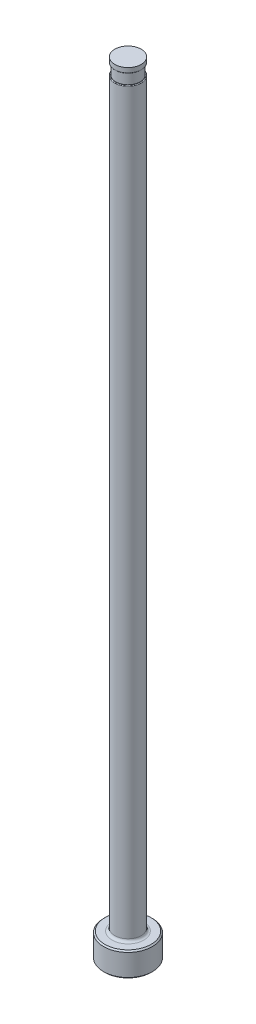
ISO-10303-21;
HEADER;
FILE_DESCRIPTION(('STEP AP214'),'2;1');
FILE_NAME('part.step','',(''),(''),'','','');
FILE_SCHEMA(('AUTOMOTIVE_DESIGN { 1 0 10303 214 1 1 1 1 }'));
ENDSEC;
DATA;
#1=APPLICATION_CONTEXT('core data for automotive mechanical design processes');
#2=APPLICATION_PROTOCOL_DEFINITION('international standard','automotive_design',2000,#1);
#3=PRODUCT_CONTEXT('',#1,'mechanical');
#4=PRODUCT('Part','Part','',(#3));
#5=PRODUCT_RELATED_PRODUCT_CATEGORY('part','',(#4));
#6=PRODUCT_DEFINITION_FORMATION('','',#4);
#7=PRODUCT_DEFINITION_CONTEXT('part definition',#1,'design');
#8=PRODUCT_DEFINITION('design','',#6,#7);
#9=PRODUCT_DEFINITION_SHAPE('','',#8);
#10=(LENGTH_UNIT() NAMED_UNIT(*) SI_UNIT(.MILLI.,.METRE.));
#11=(NAMED_UNIT(*) PLANE_ANGLE_UNIT() SI_UNIT($,.RADIAN.));
#12=(NAMED_UNIT(*) SI_UNIT($,.STERADIAN.) SOLID_ANGLE_UNIT());
#13=UNCERTAINTY_MEASURE_WITH_UNIT(LENGTH_MEASURE(1.E-05),#10,'distance_accuracy_value','');
#14=(GEOMETRIC_REPRESENTATION_CONTEXT(3) GLOBAL_UNCERTAINTY_ASSIGNED_CONTEXT((#13)) GLOBAL_UNIT_ASSIGNED_CONTEXT((#10,
#11,#12)) REPRESENTATION_CONTEXT('',''));
#15=CARTESIAN_POINT('',(0.,0.,0.));
#16=DIRECTION('',(0.,0.,1.));
#17=DIRECTION('',(1.,0.,0.));
#18=AXIS2_PLACEMENT_3D('',#15,#16,#17);
#19=CARTESIAN_POINT('',(-2.57936999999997,151.384,0.));
#20=DIRECTION('',(0.,1.,0.));
#21=DIRECTION('',(0.,0.,1.));
#22=AXIS2_PLACEMENT_3D('',#19,#20,#21);
#23=PLANE('',#22);
#24=CARTESIAN_POINT('',(0.,151.384,0.));
#25=DIRECTION('',(0.,1.,0.));
#26=DIRECTION('',(0.,0.,1.));
#27=AXIS2_PLACEMENT_3D('',#24,#25,#26);
#28=CIRCLE('',#27,2.44728999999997);
#29=CARTESIAN_POINT('',(0.,151.384,2.44728999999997));
#30=VERTEX_POINT('',#29);
#31=EDGE_CURVE('E11',#30,#30,#28,.F.);
#32=ORIENTED_EDGE('',*,*,#31,.T.);
#33=EDGE_LOOP('',(#32));
#34=FACE_BOUND('',#33,.T.);
#35=CARTESIAN_POINT('',(0.,151.384,0.));
#36=DIRECTION('',(0.,1.,0.));
#37=DIRECTION('',(0.,0.,1.));
#38=AXIS2_PLACEMENT_3D('',#35,#36,#37);
#39=CIRCLE('',#38,2.37616999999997);
#40=CARTESIAN_POINT('',(0.,151.384,2.37616999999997));
#41=VERTEX_POINT('',#40);
#42=EDGE_CURVE('E78',#41,#41,#39,.T.);
#43=ORIENTED_EDGE('',*,*,#42,.T.);
#44=EDGE_LOOP('',(#43));
#45=FACE_BOUND('',#44,.T.);
#46=ADVANCED_FACE('F36',(#34,#45),#23,.F.);
#47=CARTESIAN_POINT('',(0.,259.958771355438,0.));
#48=DIRECTION('',(0.,1.,0.));
#49=DIRECTION('',(0.,0.,1.));
#50=AXIS2_PLACEMENT_3D('',#47,#48,#49);
#51=CYLINDRICAL_SURFACE('',#50,2.57936999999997);
#52=DIRECTION('',(0.,1.,0.));
#53=VECTOR('',#52,1.);
#54=CARTESIAN_POINT('',(-2.37616999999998,259.958771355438,-1.00347681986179));
#55=LINE('',#54,#53);
#56=CARTESIAN_POINT('',(-2.37616999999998,149.225,-1.00347681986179));
#57=VERTEX_POINT('',#56);
#58=CARTESIAN_POINT('',(-2.37616999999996,86.868,-1.00347681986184));
#59=VERTEX_POINT('',#58);
#60=EDGE_CURVE('E73',#57,#59,#55,.F.);
#61=ORIENTED_EDGE('',*,*,#60,.F.);
#62=CARTESIAN_POINT('',(0.,149.225,0.));
#63=DIRECTION('',(0.,-1.,0.));
#64=DIRECTION('',(0.,0.,-1.));
#65=AXIS2_PLACEMENT_3D('',#62,#63,#64);
#66=CIRCLE('',#65,2.57936999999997);
#67=CARTESIAN_POINT('',(-2.37616999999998,149.225,1.00347681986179));
#68=VERTEX_POINT('',#67);
#69=EDGE_CURVE('E51',#57,#68,#66,.T.);
#70=ORIENTED_EDGE('',*,*,#69,.T.);
#71=DIRECTION('',(0.,1.,0.));
#72=VECTOR('',#71,1.);
#73=CARTESIAN_POINT('',(-2.37616999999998,259.958771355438,1.00347681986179));
#74=LINE('',#73,#72);
#75=CARTESIAN_POINT('',(-2.37616999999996,86.868,1.00347681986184));
#76=VERTEX_POINT('',#75);
#77=EDGE_CURVE('E84',#76,#68,#74,.T.);
#78=ORIENTED_EDGE('',*,*,#77,.F.);
#79=CARTESIAN_POINT('',(-2.37616999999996,86.868,-1.00347681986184));
#80=CARTESIAN_POINT('',(-2.3761678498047,86.8346535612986,-1.00347324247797));
#81=CARTESIAN_POINT('',(-2.37669600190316,86.8013219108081,-1.00223238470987));
#82=CARTESIAN_POINT('',(-2.37878830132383,86.7348712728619,-0.99725940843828));
#83=CARTESIAN_POINT('',(-2.3803526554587,86.7017523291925,-0.993526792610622));
#84=CARTESIAN_POINT('',(-2.38657174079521,86.602866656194,-0.978545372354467));
#85=CARTESIAN_POINT('',(-2.39275229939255,86.5377173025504,-0.963512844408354));
#86=CARTESIAN_POINT('',(-2.40858326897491,86.4109814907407,-0.923223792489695));
#87=CARTESIAN_POINT('',(-2.41823988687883,86.3494016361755,-0.897948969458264));
#88=CARTESIAN_POINT('',(-2.43994606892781,86.2320247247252,-0.83716705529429));
#89=CARTESIAN_POINT('',(-2.45199238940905,86.1762199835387,-0.801673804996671));
#90=CARTESIAN_POINT('',(-2.47634550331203,86.0751237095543,-0.722822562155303));
#91=CARTESIAN_POINT('',(-2.48860868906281,86.0294444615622,-0.679950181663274));
#92=CARTESIAN_POINT('',(-2.51236371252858,85.9470631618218,-0.586096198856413));
#93=CARTESIAN_POINT('',(-2.52385591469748,85.9103568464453,-0.535118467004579));
#94=CARTESIAN_POINT('',(-2.54336333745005,85.8508448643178,-0.432311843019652));
#95=CARTESIAN_POINT('',(-2.55161740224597,85.8269816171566,-0.381139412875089));
#96=CARTESIAN_POINT('',(-2.56521925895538,85.7885821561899,-0.27504728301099));
#97=CARTESIAN_POINT('',(-2.5705685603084,85.7740410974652,-0.220129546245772));
#98=CARTESIAN_POINT('',(-2.57742936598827,85.7555339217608,-0.112636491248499));
#99=CARTESIAN_POINT('',(-2.57920175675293,85.7508477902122,-0.0602005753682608));
#100=CARTESIAN_POINT('',(-2.57951508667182,85.750013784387,0.0447435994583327));
#101=CARTESIAN_POINT('',(-2.57805674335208,85.7538640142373,0.0972518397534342));
#102=CARTESIAN_POINT('',(-2.57214487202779,85.769773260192,0.19943543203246));
#103=CARTESIAN_POINT('',(-2.56776943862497,85.7816183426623,0.249148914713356));
#104=CARTESIAN_POINT('',(-2.55654798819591,85.8129461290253,0.345804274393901));
#105=CARTESIAN_POINT('',(-2.54970197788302,85.8324288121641,0.392746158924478));
#106=CARTESIAN_POINT('',(-2.53407309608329,85.87887953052,0.483513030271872));
#107=CARTESIAN_POINT('',(-2.52525719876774,85.9059775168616,0.527265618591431));
#108=CARTESIAN_POINT('',(-2.5066235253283,85.9666856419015,0.609736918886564));
#109=CARTESIAN_POINT('',(-2.49680555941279,86.0002970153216,0.648454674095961));
#110=CARTESIAN_POINT('',(-2.47647062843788,86.0752568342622,0.722358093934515));
#111=CARTESIAN_POINT('',(-2.46594700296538,86.1169479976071,0.757193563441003));
#112=CARTESIAN_POINT('',(-2.44575759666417,86.205357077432,0.820068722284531));
#113=CARTESIAN_POINT('',(-2.43609222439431,86.2520773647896,0.848105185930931));
#114=CARTESIAN_POINT('',(-2.41760539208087,86.3538831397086,0.89952875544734));
#115=CARTESIAN_POINT('',(-2.40894797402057,86.4093422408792,0.9222336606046));
#116=CARTESIAN_POINT('',(-2.39441308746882,86.5233120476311,0.959340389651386));
#117=CARTESIAN_POINT('',(-2.3885356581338,86.5818227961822,0.973742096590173));
#118=CARTESIAN_POINT('',(-2.38160417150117,86.6785543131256,0.990534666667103));
#119=CARTESIAN_POINT('',(-2.37957064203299,86.7162987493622,0.995396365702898));
#120=CARTESIAN_POINT('',(-2.37685226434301,86.7920255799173,1.00186164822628));
#121=CARTESIAN_POINT('',(-2.3761642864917,86.8300072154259,1.00347279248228));
#122=CARTESIAN_POINT('',(-2.37616999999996,86.868,1.00347681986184));
#123=B_SPLINE_CURVE_WITH_KNOTS('',3,(#79,#80,#81,#82,#83,#84,#85,#86,#87,#88,#89,#90,#91,#92,
#93,#94,#95,#96,#97,#98,#99,#100,#101,#102,#103,#104,#105,#106,#107,#108,#109,#110,#111,#112,
#113,#114,#115,#116,#117,#118,#119,#120,#121,#122),.UNSPECIFIED.,.F.,.F.,(4,2,2,2,2,2,2,2,2,2,2,
2,2,2,2,2,2,2,2,2,2,4),(0.,0.0999820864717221,0.199984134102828,0.400421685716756,
0.601218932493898,0.801745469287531,0.992181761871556,1.18252738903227,1.35280353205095,
1.52299110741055,1.68023815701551,1.83745028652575,1.99061412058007,2.14377753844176,
2.29973239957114,2.45571685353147,2.62103910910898,2.78643964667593,2.96734496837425,
3.14825283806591,3.26243374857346,3.37634876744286),.UNSPECIFIED.);
#124=EDGE_CURVE('E81',#59,#76,#123,.T.);
#125=ORIENTED_EDGE('',*,*,#124,.F.);
#126=EDGE_LOOP('',(#61,#70,#78,#125));
#127=FACE_BOUND('',#126,.T.);
#128=CARTESIAN_POINT('',(0.,5.25779999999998,0.));
#129=DIRECTION('',(0.,1.,0.));
#130=DIRECTION('',(0.,0.,1.));
#131=AXIS2_PLACEMENT_3D('',#128,#129,#130);
#132=CIRCLE('',#131,2.57936999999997);
#133=CARTESIAN_POINT('',(0.,5.25779999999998,2.57936999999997));
#134=VERTEX_POINT('',#133);
#135=EDGE_CURVE('E116',#134,#134,#132,.T.);
#136=ORIENTED_EDGE('',*,*,#135,.T.);
#137=EDGE_LOOP('',(#136));
#138=FACE_BOUND('',#137,.T.);
#139=ADVANCED_FACE('F82',(#127,#138),#51,.T.);
#140=CARTESIAN_POINT('',(0.,0.,0.));
#141=DIRECTION('',(0.,-1.,0.));
#142=DIRECTION('',(0.,0.,-1.));
#143=AXIS2_PLACEMENT_3D('',#140,#141,#142);
#144=PLANE('',#143);
#145=CARTESIAN_POINT('',(0.,0.,0.));
#146=DIRECTION('',(0.,-1.,0.));
#147=DIRECTION('',(0.,0.,-1.));
#148=AXIS2_PLACEMENT_3D('',#145,#146,#147);
#149=CIRCLE('',#148,4.50849999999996);
#150=CARTESIAN_POINT('',(0.,0.,-4.50849999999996));
#151=VERTEX_POINT('',#150);
#152=EDGE_CURVE('E113',#151,#151,#149,.T.);
#153=ORIENTED_EDGE('',*,*,#152,.T.);
#154=EDGE_LOOP('',(#153));
#155=FACE_BOUND('',#154,.T.);
#156=ADVANCED_FACE('F192',(#155),#144,.T.);
#157=CARTESIAN_POINT('',(0.,259.958771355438,0.));
#158=DIRECTION('',(0.,1.,0.));
#159=DIRECTION('',(0.,0.,1.));
#160=AXIS2_PLACEMENT_3D('',#157,#158,#159);
#161=CYLINDRICAL_SURFACE('',#160,4.76249999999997);
#162=CARTESIAN_POINT('',(0.,4.49579999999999,0.));
#163=DIRECTION('',(0.,1.,0.));
#164=DIRECTION('',(0.,0.,1.));
#165=AXIS2_PLACEMENT_3D('',#162,#163,#164);
#166=CIRCLE('',#165,4.76249999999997);
#167=CARTESIAN_POINT('',(0.,4.49579999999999,4.76249999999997));
#168=VERTEX_POINT('',#167);
#169=EDGE_CURVE('E110',#168,#168,#166,.F.);
#170=ORIENTED_EDGE('',*,*,#169,.T.);
#171=EDGE_LOOP('',(#170));
#172=FACE_BOUND('',#171,.T.);
#173=CARTESIAN_POINT('',(0.,0.254000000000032,0.));
#174=DIRECTION('',(0.,-1.,0.));
#175=DIRECTION('',(0.,0.,-1.));
#176=AXIS2_PLACEMENT_3D('',#173,#174,#175);
#177=CIRCLE('',#176,4.76249999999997);
#178=CARTESIAN_POINT('',(0.,0.254000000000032,-4.76249999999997));
#179=VERTEX_POINT('',#178);
#180=EDGE_CURVE('E107',#179,#179,#177,.F.);
#181=ORIENTED_EDGE('',*,*,#180,.T.);
#182=EDGE_LOOP('',(#181));
#183=FACE_BOUND('',#182,.T.);
#184=ADVANCED_FACE('F195',(#172,#183),#161,.T.);
#185=CARTESIAN_POINT('',(-4.76249999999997,4.7498,0.));
#186=DIRECTION('',(0.,1.,0.));
#187=DIRECTION('',(0.,0.,1.));
#188=AXIS2_PLACEMENT_3D('',#185,#186,#187);
#189=PLANE('',#188);
#190=CARTESIAN_POINT('',(0.,4.7498,0.));
#191=DIRECTION('',(0.,1.,0.));
#192=DIRECTION('',(0.,0.,1.));
#193=AXIS2_PLACEMENT_3D('',#190,#191,#192);
#194=CIRCLE('',#193,3.08736999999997);
#195=CARTESIAN_POINT('',(0.,4.7498,3.08736999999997));
#196=VERTEX_POINT('',#195);
#197=EDGE_CURVE('E87',#196,#196,#194,.F.);
#198=ORIENTED_EDGE('',*,*,#197,.T.);
#199=EDGE_LOOP('',(#198));
#200=FACE_BOUND('',#199,.T.);
#201=CARTESIAN_POINT('',(0.,4.7498,0.));
#202=DIRECTION('',(0.,1.,0.));
#203=DIRECTION('',(0.,0.,1.));
#204=AXIS2_PLACEMENT_3D('',#201,#202,#203);
#205=CIRCLE('',#204,4.50849999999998);
#206=CARTESIAN_POINT('',(0.,4.7498,4.50849999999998));
#207=VERTEX_POINT('',#206);
#208=EDGE_CURVE('E104',#207,#207,#205,.T.);
#209=ORIENTED_EDGE('',*,*,#208,.T.);
#210=EDGE_LOOP('',(#209));
#211=FACE_BOUND('',#210,.T.);
#212=ADVANCED_FACE('F190',(#200,#211),#189,.T.);
#213=CARTESIAN_POINT('',(0.,4.74980000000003,0.));
#214=DIRECTION('',(0.,-1.,0.));
#215=DIRECTION('',(0.,0.,-1.));
#216=AXIS2_PLACEMENT_3D('',#213,#214,#215);
#217=CONICAL_SURFACE('',#216,4.50849999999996,0.785398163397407);
#218=ORIENTED_EDGE('',*,*,#169,.F.);
#219=EDGE_LOOP('',(#218));
#220=FACE_BOUND('',#219,.T.);
#221=ORIENTED_EDGE('',*,*,#208,.F.);
#222=EDGE_LOOP('',(#221));
#223=FACE_BOUND('',#222,.T.);
#224=ADVANCED_FACE('F186',(#220,#223),#217,.T.);
#225=CARTESIAN_POINT('',(0.,0.254000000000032,0.));
#226=DIRECTION('',(0.,1.,0.));
#227=DIRECTION('',(0.,0.,1.));
#228=AXIS2_PLACEMENT_3D('',#225,#226,#227);
#229=CONICAL_SURFACE('',#228,4.76249999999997,0.785398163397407);
#230=ORIENTED_EDGE('',*,*,#152,.F.);
#231=EDGE_LOOP('',(#230));
#232=FACE_BOUND('',#231,.T.);
#233=ORIENTED_EDGE('',*,*,#180,.F.);
#234=EDGE_LOOP('',(#233));
#235=FACE_BOUND('',#234,.T.);
#236=ADVANCED_FACE('F182',(#232,#235),#229,.T.);
#237=CARTESIAN_POINT('',(0.,5.25779999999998,0.));
#238=DIRECTION('',(0.,1.,0.));
#239=DIRECTION('',(0.,0.,1.));
#240=AXIS2_PLACEMENT_3D('',#237,#238,#239);
#241=TOROIDAL_SURFACE('',#240,3.08736999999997,0.508);
#242=ORIENTED_EDGE('',*,*,#197,.F.);
#243=EDGE_LOOP('',(#242));
#244=FACE_BOUND('',#243,.T.);
#245=ORIENTED_EDGE('',*,*,#135,.F.);
#246=EDGE_LOOP('',(#245));
#247=FACE_BOUND('',#246,.T.);
#248=ADVANCED_FACE('F147',(#244,#247),#241,.F.);
#249=CARTESIAN_POINT('',(-2.57936999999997,149.352,0.));
#250=DIRECTION('',(0.,-1.,0.));
#251=DIRECTION('',(0.,0.,-1.));
#252=AXIS2_PLACEMENT_3D('',#249,#250,#251);
#253=PLANE('',#252);
#254=DIRECTION('',(0.,0.,1.));
#255=VECTOR('',#254,1.);
#256=CARTESIAN_POINT('',(-2.37616999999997,149.352,0.));
#257=LINE('',#256,#255);
#258=CARTESIAN_POINT('',(-2.37616999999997,149.352,0.));
#259=VERTEX_POINT('',#258);
#260=CARTESIAN_POINT('',(-2.37616999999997,149.352,0.60657625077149));
#261=VERTEX_POINT('',#260);
#262=EDGE_CURVE('E90',#259,#261,#257,.T.);
#263=ORIENTED_EDGE('',*,*,#262,.T.);
#264=CARTESIAN_POINT('',(0.,149.352,0.));
#265=DIRECTION('',(0.,-1.,0.));
#266=DIRECTION('',(0.,0.,-1.));
#267=AXIS2_PLACEMENT_3D('',#264,#265,#266);
#268=CIRCLE('',#267,2.45236999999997);
#269=CARTESIAN_POINT('',(-2.37616999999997,149.352,-0.60657625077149));
#270=VERTEX_POINT('',#269);
#271=EDGE_CURVE('E86',#261,#270,#268,.F.);
#272=ORIENTED_EDGE('',*,*,#271,.T.);
#273=EDGE_CURVE('E79',#270,#259,#257,.T.);
#274=ORIENTED_EDGE('',*,*,#273,.T.);
#275=CARTESIAN_POINT('',(0.,149.352,0.));
#276=DIRECTION('',(0.,1.,0.));
#277=DIRECTION('',(0.,0.,1.));
#278=AXIS2_PLACEMENT_3D('',#275,#276,#277);
#279=CIRCLE('',#278,2.37616999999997);
#280=EDGE_CURVE('E101',#259,#259,#279,.T.);
#281=ORIENTED_EDGE('',*,*,#280,.F.);
#282=EDGE_LOOP('',(#263,#272,#274,#281));
#283=FACE_BOUND('',#282,.T.);
#284=ADVANCED_FACE('F144',(#283),#253,.F.);
#285=CARTESIAN_POINT('',(0.,153.448281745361,0.));
#286=DIRECTION('',(0.,1.,0.));
#287=DIRECTION('',(0.,0.,1.));
#288=AXIS2_PLACEMENT_3D('',#285,#286,#287);
#289=CYLINDRICAL_SURFACE('',#288,2.37616999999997);
#290=ORIENTED_EDGE('',*,*,#42,.F.);
#291=EDGE_LOOP('',(#290));
#292=FACE_BOUND('',#291,.T.);
#293=ORIENTED_EDGE('',*,*,#280,.T.);
#294=EDGE_LOOP('',(#293));
#295=FACE_BOUND('',#294,.T.);
#296=ADVANCED_FACE('F141',(#292,#295),#289,.T.);
#297=CARTESIAN_POINT('',(-2.37616999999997,150.368,-4.76249999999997));
#298=DIRECTION('',(1.,0.,0.));
#299=DIRECTION('',(0.,1.,0.));
#300=AXIS2_PLACEMENT_3D('',#297,#298,#299);
#301=PLANE('',#300);
#302=ORIENTED_EDGE('',*,*,#273,.F.);
#303=CARTESIAN_POINT('',(-2.37616999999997,149.352,-0.60657625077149));
#304=CARTESIAN_POINT('',(-2.37616999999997,149.351986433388,-0.627774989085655));
#305=CARTESIAN_POINT('',(-2.37616999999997,149.351673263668,-0.648986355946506));
#306=CARTESIAN_POINT('',(-2.37616999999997,149.350169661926,-0.691484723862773));
#307=CARTESIAN_POINT('',(-2.37616999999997,149.348974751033,-0.712771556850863));
#308=CARTESIAN_POINT('',(-2.37616999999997,149.345417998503,-0.755326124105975));
#309=CARTESIAN_POINT('',(-2.37616999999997,149.343052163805,-0.776593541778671));
#310=CARTESIAN_POINT('',(-2.37616999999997,149.336718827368,-0.81886333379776));
#311=CARTESIAN_POINT('',(-2.37616999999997,149.332755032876,-0.839866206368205));
#312=CARTESIAN_POINT('',(-2.37616999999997,149.325365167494,-0.869601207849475));
#313=CARTESIAN_POINT('',(-2.37616999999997,149.322897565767,-0.878570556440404));
#314=CARTESIAN_POINT('',(-2.37616999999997,149.317395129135,-0.896363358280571));
#315=CARTESIAN_POINT('',(-2.37616999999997,149.314358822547,-0.905186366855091));
#316=CARTESIAN_POINT('',(-2.37616999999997,149.307046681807,-0.923923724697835));
#317=CARTESIAN_POINT('',(-2.37616999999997,149.302651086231,-0.933791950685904));
#318=CARTESIAN_POINT('',(-2.37616999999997,149.292570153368,-0.952838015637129));
#319=CARTESIAN_POINT('',(-2.37616999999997,149.286891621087,-0.962019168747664));
#320=CARTESIAN_POINT('',(-2.37616999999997,149.277665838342,-0.973806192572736));
#321=CARTESIAN_POINT('',(-2.37616999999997,149.274910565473,-0.977026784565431));
#322=CARTESIAN_POINT('',(-2.37616999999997,149.269048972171,-0.983149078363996));
#323=CARTESIAN_POINT('',(-2.37616999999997,149.265942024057,-0.986050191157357));
#324=CARTESIAN_POINT('',(-2.37616999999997,149.259290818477,-0.99142303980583));
#325=CARTESIAN_POINT('',(-2.37616999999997,149.255740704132,-0.99388768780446));
#326=CARTESIAN_POINT('',(-2.37616999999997,149.248248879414,-0.998099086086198));
#327=CARTESIAN_POINT('',(-2.37616999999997,149.2443097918,-0.999850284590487));
#328=CARTESIAN_POINT('',(-2.37616999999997,149.237771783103,-1.00188288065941));
#329=CARTESIAN_POINT('',(-2.37616999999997,149.235268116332,-1.00247204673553));
#330=CARTESIAN_POINT('',(-2.37616999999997,149.230178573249,-1.00327288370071));
#331=CARTESIAN_POINT('',(-2.37616999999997,149.227592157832,-1.00348108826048));
#332=CARTESIAN_POINT('',(-2.37616999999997,149.225,-1.00347681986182));
#333=B_SPLINE_CURVE_WITH_KNOTS('',3,(#303,#304,#305,#306,#307,#308,#309,#310,#311,#312,#313,
#314,#315,#316,#317,#318,#319,#320,#321,#322,#323,#324,#325,#326,#327,#328,#329,#330,#331,#332),
.UNSPECIFIED.,.F.,.F.,(4,2,2,2,2,2,2,2,2,2,2,2,2,2,4),(0.,0.0636141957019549,0.12755376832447,
0.191712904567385,0.255724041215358,0.283618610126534,0.311586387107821,0.343944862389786,
0.376135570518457,0.388831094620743,0.401549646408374,0.414458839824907,0.4272862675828,
0.434975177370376,0.442733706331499),.UNSPECIFIED.);
#334=EDGE_CURVE('E59',#270,#57,#333,.T.);
#335=ORIENTED_EDGE('',*,*,#334,.T.);
#336=ORIENTED_EDGE('',*,*,#60,.T.);
#337=DIRECTION('',(0.,0.,1.));
#338=VECTOR('',#337,1.);
#339=CARTESIAN_POINT('',(-2.37616999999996,86.868,-4.76249999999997));
#340=LINE('',#339,#338);
#341=EDGE_CURVE('E77',#59,#76,#340,.T.);
#342=ORIENTED_EDGE('',*,*,#341,.T.);
#343=ORIENTED_EDGE('',*,*,#77,.T.);
#344=CARTESIAN_POINT('',(-2.37616999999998,149.225,1.00347681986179));
#345=CARTESIAN_POINT('',(-2.37616999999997,149.22808677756,1.00348533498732));
#346=CARTESIAN_POINT('',(-2.37616999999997,149.231162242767,1.00318798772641));
#347=CARTESIAN_POINT('',(-2.37616999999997,149.237176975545,1.00206106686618));
#348=CARTESIAN_POINT('',(-2.37616999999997,149.240117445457,1.00123801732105));
#349=CARTESIAN_POINT('',(-2.37616999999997,149.246507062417,0.998885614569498));
#350=CARTESIAN_POINT('',(-2.37616999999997,149.249910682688,0.997234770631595));
#351=CARTESIAN_POINT('',(-2.37616999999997,149.256418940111,0.993404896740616));
#352=CARTESIAN_POINT('',(-2.37616999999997,149.259521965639,0.99122321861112));
#353=CARTESIAN_POINT('',(-2.37616999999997,149.267245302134,0.985017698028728));
#354=CARTESIAN_POINT('',(-2.37616999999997,149.27161779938,0.980688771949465));
#355=CARTESIAN_POINT('',(-2.37616999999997,149.279686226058,0.971452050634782));
#356=CARTESIAN_POINT('',(-2.37616999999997,149.283380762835,0.966543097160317));
#357=CARTESIAN_POINT('',(-2.37616999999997,149.293861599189,0.950989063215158));
#358=CARTESIAN_POINT('',(-2.37616999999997,149.299783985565,0.939769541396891));
#359=CARTESIAN_POINT('',(-2.37616999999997,149.310142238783,0.916677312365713));
#360=CARTESIAN_POINT('',(-2.37616999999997,149.314573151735,0.904802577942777));
#361=CARTESIAN_POINT('',(-2.37616999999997,149.324828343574,0.873126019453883));
#362=CARTESIAN_POINT('',(-2.37616999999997,149.329772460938,0.85304212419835));
#363=CARTESIAN_POINT('',(-2.37616999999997,149.337834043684,0.812501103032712));
#364=CARTESIAN_POINT('',(-2.37616999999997,149.340947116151,0.792043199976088));
#365=CARTESIAN_POINT('',(-2.37616999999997,149.348347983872,0.730361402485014));
#366=CARTESIAN_POINT('',(-2.37616999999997,149.350678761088,0.688903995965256));
#367=CARTESIAN_POINT('',(-2.37616999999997,149.351717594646,0.640645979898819));
#368=CARTESIAN_POINT('',(-2.37616999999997,149.3518254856,0.633819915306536));
#369=CARTESIAN_POINT('',(-2.37616999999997,149.351967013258,0.620188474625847));
#370=CARTESIAN_POINT('',(-2.37616999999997,149.352000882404,0.613383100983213));
#371=CARTESIAN_POINT('',(-2.37616999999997,149.352,0.606576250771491));
#372=B_SPLINE_CURVE_WITH_KNOTS('',3,(#344,#345,#346,#347,#348,#349,#350,#351,#352,#353,#354,
#355,#356,#357,#358,#359,#360,#361,#362,#363,#364,#365,#366,#367,#368,#369,#370,#371),
.UNSPECIFIED.,.F.,.F.,(4,2,2,2,2,2,2,2,2,2,2,2,2,4),(0.,0.00922779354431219,0.0183432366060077,
0.0296284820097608,0.0409712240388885,0.0593256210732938,0.0777173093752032,0.115565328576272,
0.153537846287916,0.215427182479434,0.277464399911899,0.401767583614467,0.422249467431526,
0.44266694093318),.UNSPECIFIED.);
#373=EDGE_CURVE('E172',#68,#261,#372,.T.);
#374=ORIENTED_EDGE('',*,*,#373,.T.);
#375=ORIENTED_EDGE('',*,*,#262,.F.);
#376=EDGE_LOOP('',(#302,#335,#336,#342,#343,#374,#375));
#377=FACE_BOUND('',#376,.T.);
#378=ADVANCED_FACE('F75',(#377),#301,.F.);
#379=CARTESIAN_POINT('',(-5.55116999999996,86.868,-4.76249999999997));
#380=DIRECTION('',(0.,0.,1.));
#381=DIRECTION('',(1.,0.,0.));
#382=AXIS2_PLACEMENT_3D('',#379,#380,#381);
#383=CYLINDRICAL_SURFACE('',#382,3.175);
#384=ORIENTED_EDGE('',*,*,#341,.F.);
#385=ORIENTED_EDGE('',*,*,#124,.T.);
#386=EDGE_LOOP('',(#384,#385));
#387=FACE_BOUND('',#386,.T.);
#388=ADVANCED_FACE('F89',(#387),#383,.F.);
#389=CARTESIAN_POINT('',(0.,152.687735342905,0.));
#390=DIRECTION('',(0.,1.,0.));
#391=DIRECTION('',(0.,0.,1.));
#392=AXIS2_PLACEMENT_3D('',#389,#390,#391);
#393=CYLINDRICAL_SURFACE('',#392,2.57428999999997);
#394=CARTESIAN_POINT('',(0.,151.511,0.));
#395=DIRECTION('',(0.,1.,0.));
#396=DIRECTION('',(0.,0.,1.));
#397=AXIS2_PLACEMENT_3D('',#394,#395,#396);
#398=CIRCLE('',#397,2.57428999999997);
#399=CARTESIAN_POINT('',(0.,151.511,2.57428999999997));
#400=VERTEX_POINT('',#399);
#401=EDGE_CURVE('E44',#400,#400,#398,.T.);
#402=ORIENTED_EDGE('',*,*,#401,.T.);
#403=EDGE_LOOP('',(#402));
#404=FACE_BOUND('',#403,.T.);
#405=CARTESIAN_POINT('',(0.,152.4,0.));
#406=DIRECTION('',(0.,1.,0.));
#407=DIRECTION('',(0.,0.,1.));
#408=AXIS2_PLACEMENT_3D('',#405,#406,#407);
#409=CIRCLE('',#408,2.57428999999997);
#410=CARTESIAN_POINT('',(0.,152.4,2.57428999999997));
#411=VERTEX_POINT('',#410);
#412=EDGE_CURVE('E91',#411,#411,#409,.T.);
#413=ORIENTED_EDGE('',*,*,#412,.F.);
#414=EDGE_LOOP('',(#413));
#415=FACE_BOUND('',#414,.T.);
#416=ADVANCED_FACE('F135',(#404,#415),#393,.T.);
#417=CARTESIAN_POINT('',(-2.57936999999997,152.4,0.));
#418=DIRECTION('',(0.,1.,0.));
#419=DIRECTION('',(0.,0.,1.));
#420=AXIS2_PLACEMENT_3D('',#417,#418,#419);
#421=PLANE('',#420);
#422=ORIENTED_EDGE('',*,*,#412,.T.);
#423=EDGE_LOOP('',(#422));
#424=FACE_BOUND('',#423,.T.);
#425=ADVANCED_FACE('F149',(#424),#421,.T.);
#426=CARTESIAN_POINT('',(0.,149.225,0.));
#427=DIRECTION('',(0.,-1.,0.));
#428=DIRECTION('',(0.,0.,-1.));
#429=AXIS2_PLACEMENT_3D('',#426,#427,#428);
#430=TOROIDAL_SURFACE('',#429,2.45236999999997,0.127);
#431=ORIENTED_EDGE('',*,*,#373,.F.);
#432=ORIENTED_EDGE('',*,*,#69,.F.);
#433=ORIENTED_EDGE('',*,*,#334,.F.);
#434=ORIENTED_EDGE('',*,*,#271,.F.);
#435=EDGE_LOOP('',(#431,#432,#433,#434));
#436=FACE_BOUND('',#435,.T.);
#437=ADVANCED_FACE('F151',(#436),#430,.T.);
#438=CARTESIAN_POINT('',(0.,151.511,0.));
#439=DIRECTION('',(0.,1.,0.));
#440=DIRECTION('',(0.,0.,1.));
#441=AXIS2_PLACEMENT_3D('',#438,#439,#440);
#442=TOROIDAL_SURFACE('',#441,2.44728999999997,0.127);
#443=ORIENTED_EDGE('',*,*,#31,.F.);
#444=EDGE_LOOP('',(#443));
#445=FACE_BOUND('',#444,.T.);
#446=ORIENTED_EDGE('',*,*,#401,.F.);
#447=EDGE_LOOP('',(#446));
#448=FACE_BOUND('',#447,.T.);
#449=ADVANCED_FACE('F38',(#445,#448),#442,.T.);
#450=CLOSED_SHELL('',(#46,#139,#156,#184,#212,#224,#236,#248,#284,#296,#378,#388,#416,#425,#437,#449));
#451=MANIFOLD_SOLID_BREP('B2',#450);
#452=ADVANCED_BREP_SHAPE_REPRESENTATION('',(#18,#451),#14);
#453=SHAPE_DEFINITION_REPRESENTATION(#9,#452);
ENDSEC;
END-ISO-10303-21;
